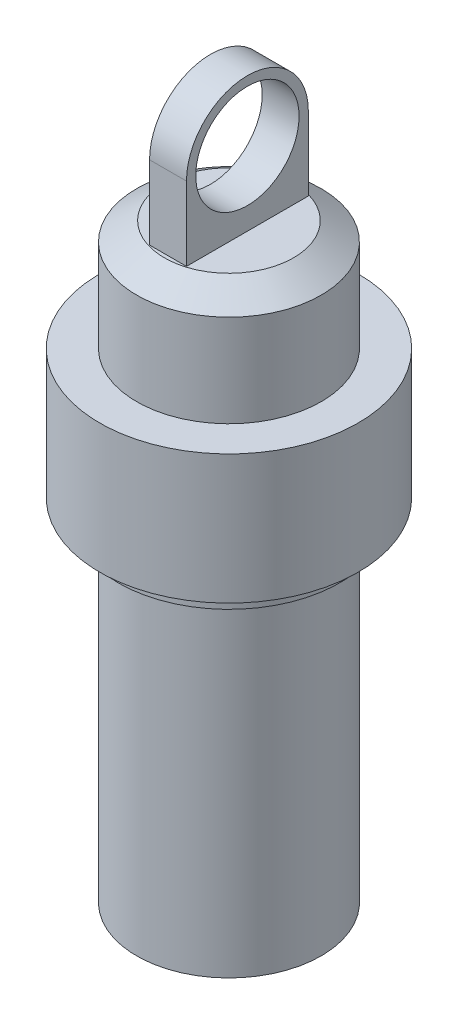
from build123d import *

# Parameters (mm, degrees)
SALIENTE_EXTRUIR1_DEPTH      = 1
SALIENTE_EXTRUIR1_DEPTH_BACK = 1
CROQUIS2_R                   = 2.8


with BuildPart() as part:
    # Croquis1 → Revoluci_n1 (revolve)
    with BuildSketch(Plane(origin=(0, 0, 0), x_dir=(0, 0, -1), z_dir=(1, 0, 0))):
        Polygon((2, 0), (2, 2), (0.75, 2), (0.75, 27), (0, 27), (0, 32), (3.5, 32), (5, 31), (5, 26), (7, 26), (7, 19), (6, 19), (6, 18), (5, 18), (5, 0), align=None)
    revolve(axis=Axis((0, 0, 0), (0, 1, 0)))


with BuildPart() as body_2:
    # Croquis2 → Saliente-Extruir1 (new, two sides: drawn at the far end of the back side and taken through both)
    with BuildSketch(Plane(origin=(0, 0, 0), x_dir=(0, 0, -1), z_dir=(1, 0, 0)).offset(-SALIENTE_EXTRUIR1_DEPTH_BACK)):
        with BuildLine():
            ThreePointArc((3.3, 36), (0, 39.3), (-3.3, 36))
            Line((-3.3, 36), (-3.3, 32))
            Line((-3.3, 32), (3.3, 32))
            Line((3.3, 32), (3.3, 36))
        make_face()
        with Locations((0, 36)):
            Circle(CROQUIS2_R, mode=Mode.SUBTRACT)
    extrude(amount=SALIENTE_EXTRUIR1_DEPTH + SALIENTE_EXTRUIR1_DEPTH_BACK)


solid = Compound([part.part, body_2.part])
